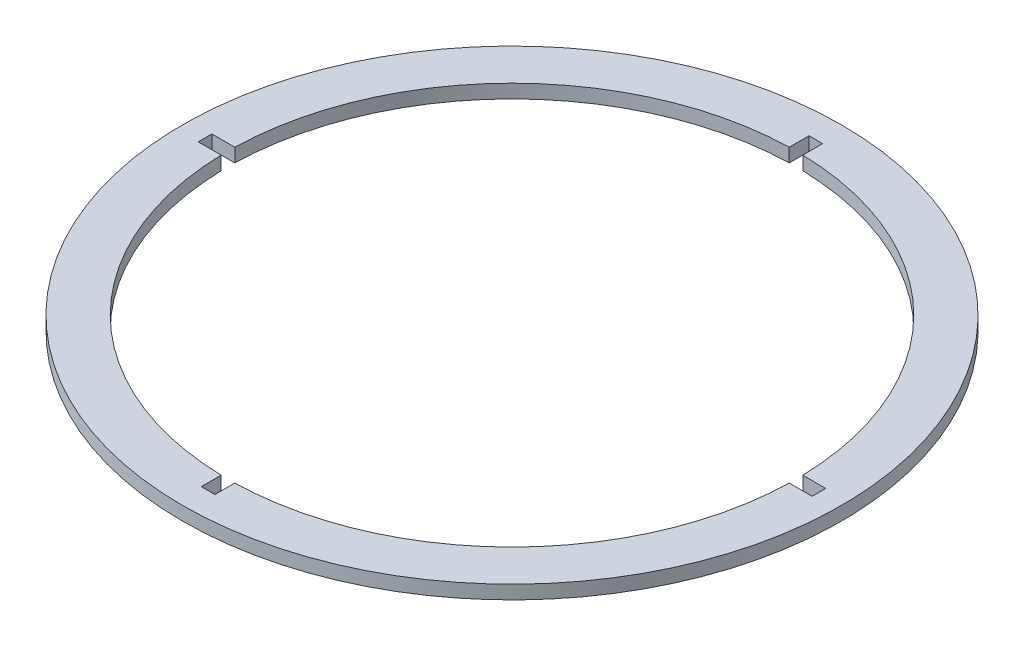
from build123d import *

# Parameters (mm, degrees)
SKETCH1_R           = 290
BOSS_EXTRUDE1_DEPTH = 12


with BuildPart() as part:
    # Sketch1 → Boss-Extrude1 (new body)
    with BuildSketch(Plane(origin=(0, 0, 0), x_dir=(1, 0, 0), z_dir=(0, 1, 0))):
        with Locations(Location((0, 0, 0), (0, 0, 270))):
            Circle(SKETCH1_R)
        with BuildLine():
            ThreePointArc((249.927989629, 6), (176.776695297, 176.776695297), (6, 249.927989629))
            Line((6, 249.927989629), (6, 267.411669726))
            Line((6, 267.411669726), (-6, 267.411669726))
            Line((-6, 267.411669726), (-6, 249.927989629))
            ThreePointArc((-6, 249.927989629), (-176.776695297, 176.776695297), (-249.927989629, 6))
            Line((-249.927989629, 6), (-270.134023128, 6))
            Line((-270.134023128, 6), (-270.134023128, -6))
            Line((-270.134023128, -6), (-249.927989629, -6))
            ThreePointArc((-249.927989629, -6), (-176.776695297, -176.776695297), (-6, -249.927989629))
            Line((-6, -249.927989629), (-6, -267.411669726))
            Line((-6, -267.411669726), (6, -267.411669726))
            Line((6, -267.411669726), (6, -249.927989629))
            ThreePointArc((6, -249.927989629), (176.776695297, -176.776695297), (249.927989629, -6))
            Line((249.927989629, -6), (270.134023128, -6))
            Line((270.134023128, -6), (270.134023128, 6))
            Line((270.134023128, 6), (249.927989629, 6))
        make_face(mode=Mode.SUBTRACT)
    extrude(amount=BOSS_EXTRUDE1_DEPTH)


solid = part.part
